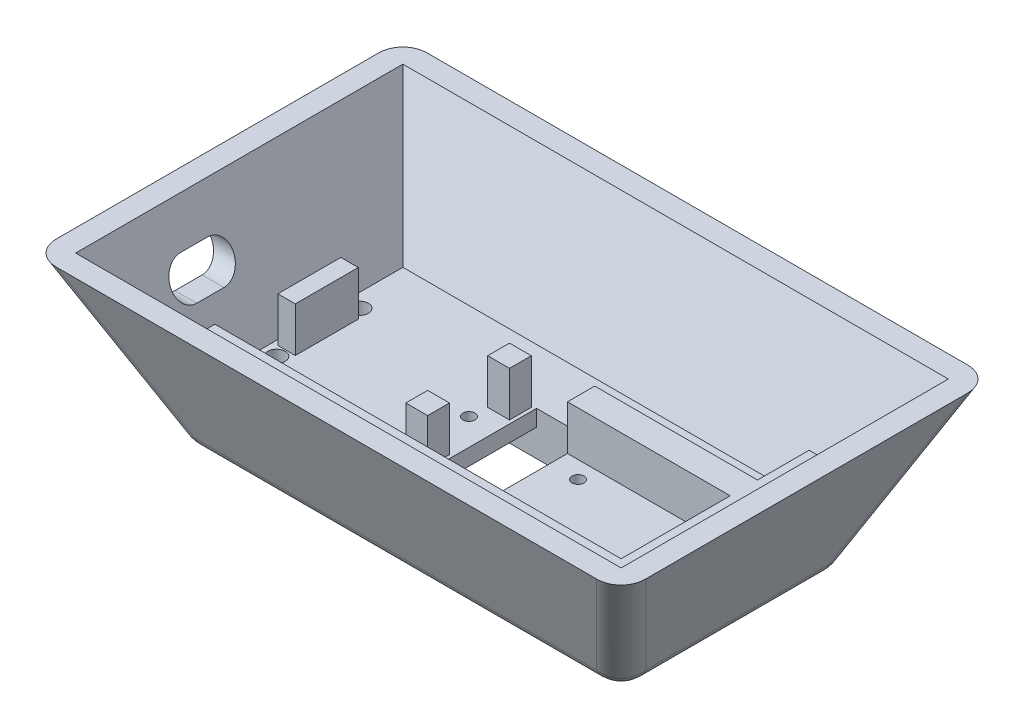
from build123d import *

# Parameters (mm, degrees)
SKETCH1_W                = 80
SKETCH1_H                = 40
BOSS_EXTRUDE1_DEPTH      = 30
BOSS_EXTRUDE1_DRAFT      = -25
SKETCH2_W                = 30.2
SKETCH2_H                = 19.2
CUT_EXTRUDE1_DEPTH       = 5
SKETCH3_W                = 99.97845949
SKETCH3_H                = 59.97845949
CUT_EXTRUDE3_DEPTH       = 22
CUT_EXTRUDE3_DRAFT       = -25
CUT_EXTRUDE4_REACH       = 70.521
SKETCH5_R                = 1.1
SKETCH5_W                = 10
SKETCH5_H                = 19.2
SKETCH6_R                = 1.6
PCB_HEATSETINSERTS_DEPTH = 4.75
SKETCH7_W                = 4
SKETCH7_H                = 4
SKETCH7_W_2              = 3.2
SKETCH7_H_2              = 11.55
BOSS_EXTRUDE3_DEPTH      = 8.2
USB_C_CUTOUT_REACH       = 102.398
FILLET1_R                = 5


with BuildPart() as part:
    # Sketch1 → Boss-Extrude1 (with draft: the straight prism first)
    with BuildSketch(Plane(origin=(0, 0, 0), x_dir=(1, 0, 0), z_dir=(0, 1, 0))):
        Rectangle(SKETCH1_W, SKETCH1_H)
    extrude(amount=BOSS_EXTRUDE1_DEPTH)
    # Boss-Extrude1: the draft: its side faces are tilted about the plane it starts from
    boss_extrude1_sides = [part.faces().sort_by_distance(p)[0] for p in [
        (-40, 15, 0),
        (0, 15, 20),
        (40, 15, 0),
        (0, 15, -20),
    ]]
    draft(boss_extrude1_sides, Plane(origin=(0, 0, 0), x_dir=(1, 0, 0), z_dir=(0, 1, 0)), BOSS_EXTRUDE1_DRAFT)

    # Sketch2 → Cut-Extrude1 (cut)
    with BuildSketch(Plane.XZ):
        Rectangle(SKETCH2_W, SKETCH2_H)
    extrude(amount=-CUT_EXTRUDE1_DEPTH, mode=Mode.SUBTRACT)


with BuildPart() as cut_extrude3_tool:
    # Sketch3 → Cut-Extrude3 (with draft: the straight prism first)
    with BuildSketch(Plane(origin=(0, 30, 0), x_dir=(1, 0, 0), z_dir=(0, 1, 0))):
        Rectangle(SKETCH3_W, SKETCH3_H)
    extrude(amount=-CUT_EXTRUDE3_DEPTH)
    # Cut-Extrude3: the draft: its side faces are tilted about the plane it starts from
    cut_extrude3_sides = [cut_extrude3_tool.faces().sort_by_distance(p)[0] for p in [
        (-49.989229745, 19, 0),
        (0, 19, 29.989229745),
        (49.989229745, 19, 0),
        (0, 19, -29.989229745),
    ]]
    draft(cut_extrude3_sides, Plane(origin=(0, 30, 0), x_dir=(1, 0, 0), z_dir=(0, 1, 0)), CUT_EXTRUDE3_DRAFT)


with BuildPart() as part_1:
    add(part.part)

    # Cut-Extrude3: cut by cut_extrude3_tool
    add(cut_extrude3_tool.part, mode=Mode.SUBTRACT)

    # Sketch5 → Cut-Extrude4 (cut, up to next)
    with BuildSketch(Plane.XZ.offset(-5), mode=Mode.PRIVATE) as cut_extrude4_sk1:
        with Locations(Location((-10, -2.1, 0), (0, 0, 270))):
            Circle(SKETCH5_R)
    cut_extrude4_tool1 = extrude(cut_extrude4_sk1.sketch, amount=-CUT_EXTRUDE4_REACH, mode=Mode.PRIVATE) & part_1.part
    # Sketch5 → Cut-Extrude4 (cut, up to next)
    with BuildSketch(Plane.XZ.offset(-5), mode=Mode.PRIVATE) as cut_extrude4_sk2:
        with Locations(Location((10, -2.1, 0), (0, 0, 270))):
            Circle(SKETCH5_R)
    cut_extrude4_tool2 = extrude(cut_extrude4_sk2.sketch, amount=-CUT_EXTRUDE4_REACH, mode=Mode.PRIVATE) & part_1.part
    # Sketch5 → Cut-Extrude4 (cut, up to next)
    with BuildSketch(Plane.XZ.offset(-5), mode=Mode.PRIVATE) as cut_extrude4_sk3:
        with Locations((-0.1, 0)):
            Rectangle(SKETCH5_W, SKETCH5_H)
    cut_extrude4_tool3 = extrude(cut_extrude4_sk3.sketch, amount=-CUT_EXTRUDE4_REACH, mode=Mode.PRIVATE) & part_1.part
    add(cut_extrude4_tool1.solids().sort_by_distance((-10, 5, -2.1))[0], mode=Mode.SUBTRACT)
    add(cut_extrude4_tool2.solids().sort_by_distance((10, 5, -2.1))[0], mode=Mode.SUBTRACT)
    add(cut_extrude4_tool3.solids().sort_by_distance((-0.1, 5, 0))[0], mode=Mode.SUBTRACT)

    # Sketch6 → PCB_HeatSetInserts (cut)
    with BuildSketch(Plane(origin=(0, 8, 0), x_dir=(1, 0, 0), z_dir=(0, 1, 0))):
        with Locations(Location((-37.190461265, -5.98, 0), (0, 0, 270))):
            Circle(SKETCH6_R)
        with Locations(Location((-37.190461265, 9.27, 0), (0, 0, 270))):
            Circle(SKETCH6_R)
    extrude(amount=-PCB_HEATSETINSERTS_DEPTH, mode=Mode.SUBTRACT)

    # Sketch7 → Boss-Extrude3 (add)
    with BuildSketch(Plane(origin=(0, 8, 0), x_dir=(1, 0, 0), z_dir=(0, 1, 0))):
        with Locations((-7.730461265, -7.730461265)):
            Rectangle(SKETCH7_W, SKETCH7_H)
        with Locations((-37.190461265, 1.645)):
            Rectangle(SKETCH7_W_2, SKETCH7_H_2)
        with Locations((-7.730461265, 7.269538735)):
            Rectangle(SKETCH7_W, SKETCH7_H)
        Polygon((-39.730461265, -19.730461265), (-39.730461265, -14.730461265), (34.730461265, -14.730461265), (34.730461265, 5.269538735), (4.9, 5.269538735), (4.9, 10.269538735), (34.730461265, 10.269538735), (34.730461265, 19.730461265), (39.730461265, 19.730461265), (39.730461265, -19.730461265), align=None)
    extrude(amount=BOSS_EXTRUDE3_DEPTH)

    # USB-C Cutout: up to this plane
    usb_c_cutout_end = Plane(origin=(-40, 0, -20), z_dir=(-0.9063077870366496, -0.4226182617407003, 0))
    # Sketch10 → USB-C Cutout (cut, up to the surface)
    with BuildSketch(Plane(origin=(-35.590461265, 0, 0), x_dir=(0, 0, -1), z_dir=(1, 0, 0)), mode=Mode.PRIVATE) as usb_c_cutout_sk1:
        with BuildLine():
            Line((-13.855, 23.5), (-8.855, 23.5))
            ThreePointArc((-8.855, 23.5), (-5.605, 20.25), (-8.855, 17))
            Line((-8.855, 17), (-13.855, 17))
            ThreePointArc((-13.855, 17), (-17.105, 20.25), (-13.855, 23.5))
        make_face()
    usb_c_cutout_tool1 = split(extrude(usb_c_cutout_sk1.sketch, amount=-USB_C_CUTOUT_REACH, mode=Mode.PRIVATE), bisect_by=usb_c_cutout_end, keep=Keep.BOTH, mode=Mode.PRIVATE)
    add(usb_c_cutout_tool1.solids().sort_by_distance((-35.590461, 20.25, 11.355))[0], mode=Mode.SUBTRACT)

    # Fillet1
    fillet1_edges = [part_1.edges().sort_by_distance(p)[0] for p in [
        (0, 0, 20),
        (-40, 0, 0),
        (0, 0, -20),
        (40, 0, 0),
        (46.994614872, 15, 26.994614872),
        (-46.994614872, 15, 26.994614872),
        (-46.994614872, 15, -26.994614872),
        (46.994614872, 15, -26.994614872),
    ]]
    fillet(fillet1_edges, radius=FILLET1_R)


solid = part_1.part
